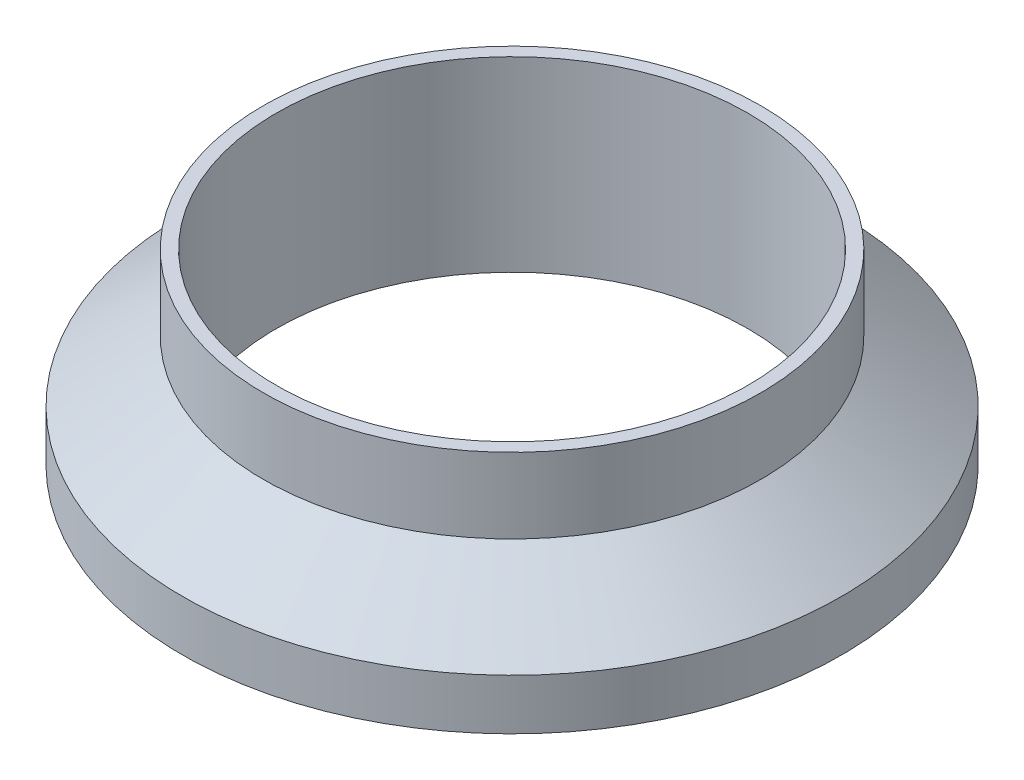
ISO-10303-21;
HEADER;
FILE_DESCRIPTION(('STEP AP214'),'2;1');
FILE_NAME('part.step','',(''),(''),'','','');
FILE_SCHEMA(('AUTOMOTIVE_DESIGN { 1 0 10303 214 1 1 1 1 }'));
ENDSEC;
DATA;
#1=APPLICATION_CONTEXT('core data for automotive mechanical design processes');
#2=APPLICATION_PROTOCOL_DEFINITION('international standard','automotive_design',2000,#1);
#3=PRODUCT_CONTEXT('',#1,'mechanical');
#4=PRODUCT('Part','Part','',(#3));
#5=PRODUCT_RELATED_PRODUCT_CATEGORY('part','',(#4));
#6=PRODUCT_DEFINITION_FORMATION('','',#4);
#7=PRODUCT_DEFINITION_CONTEXT('part definition',#1,'design');
#8=PRODUCT_DEFINITION('design','',#6,#7);
#9=PRODUCT_DEFINITION_SHAPE('','',#8);
#10=(LENGTH_UNIT() NAMED_UNIT(*) SI_UNIT(.MILLI.,.METRE.));
#11=(NAMED_UNIT(*) PLANE_ANGLE_UNIT() SI_UNIT($,.RADIAN.));
#12=(NAMED_UNIT(*) SI_UNIT($,.STERADIAN.) SOLID_ANGLE_UNIT());
#13=UNCERTAINTY_MEASURE_WITH_UNIT(LENGTH_MEASURE(1.E-05),#10,'distance_accuracy_value','');
#14=(GEOMETRIC_REPRESENTATION_CONTEXT(3) GLOBAL_UNCERTAINTY_ASSIGNED_CONTEXT((#13)) GLOBAL_UNIT_ASSIGNED_CONTEXT((#10,
#11,#12)) REPRESENTATION_CONTEXT('',''));
#15=CARTESIAN_POINT('',(0.,0.,0.));
#16=DIRECTION('',(0.,0.,1.));
#17=DIRECTION('',(1.,0.,0.));
#18=AXIS2_PLACEMENT_3D('',#15,#16,#17);
#19=CARTESIAN_POINT('',(-30.099,0.,0.));
#20=DIRECTION('',(0.,1.,0.));
#21=DIRECTION('',(0.,0.,1.));
#22=AXIS2_PLACEMENT_3D('',#19,#20,#21);
#23=PLANE('',#22);
#24=CARTESIAN_POINT('',(0.,0.,0.));
#25=DIRECTION('',(0.,-1.,0.));
#26=DIRECTION('',(0.,0.,-1.));
#27=AXIS2_PLACEMENT_3D('',#24,#25,#26);
#28=CIRCLE('',#27,30.099);
#29=CARTESIAN_POINT('',(0.,0.,-30.099));
#30=VERTEX_POINT('',#29);
#31=EDGE_CURVE('E10',#30,#30,#28,.T.);
#32=ORIENTED_EDGE('',*,*,#31,.F.);
#33=EDGE_LOOP('',(#32));
#34=FACE_BOUND('',#33,.T.);
#35=CARTESIAN_POINT('',(0.,0.,0.));
#36=DIRECTION('',(0.,-1.,0.));
#37=DIRECTION('',(0.,0.,-1.));
#38=AXIS2_PLACEMENT_3D('',#35,#36,#37);
#39=CIRCLE('',#38,34.9209836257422);
#40=CARTESIAN_POINT('',(0.,0.,-34.9209836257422));
#41=VERTEX_POINT('',#40);
#42=EDGE_CURVE('E59',#41,#41,#39,.T.);
#43=ORIENTED_EDGE('',*,*,#42,.T.);
#44=EDGE_LOOP('',(#43));
#45=FACE_BOUND('',#44,.T.);
#46=ADVANCED_FACE('F31',(#34,#45),#23,.F.);
#47=CARTESIAN_POINT('',(0.,0.,0.));
#48=DIRECTION('',(0.,-1.,0.));
#49=DIRECTION('',(0.,0.,-1.));
#50=AXIS2_PLACEMENT_3D('',#47,#48,#49);
#51=CYLINDRICAL_SURFACE('',#50,30.099);
#52=CARTESIAN_POINT('',(0.,23.8252,0.));
#53=DIRECTION('',(0.,-1.,0.));
#54=DIRECTION('',(0.,0.,-1.));
#55=AXIS2_PLACEMENT_3D('',#52,#53,#54);
#56=CIRCLE('',#55,30.099);
#57=CARTESIAN_POINT('',(0.,23.8252,-30.099));
#58=VERTEX_POINT('',#57);
#59=EDGE_CURVE('E37',#58,#58,#56,.T.);
#60=ORIENTED_EDGE('',*,*,#59,.F.);
#61=EDGE_LOOP('',(#60));
#62=FACE_BOUND('',#61,.T.);
#63=ORIENTED_EDGE('',*,*,#31,.T.);
#64=EDGE_LOOP('',(#63));
#65=FACE_BOUND('',#64,.T.);
#66=ADVANCED_FACE('F96',(#62,#65),#51,.F.);
#67=CARTESIAN_POINT('',(-30.099,23.8252,0.));
#68=DIRECTION('',(0.,-1.,0.));
#69=DIRECTION('',(0.,0.,-1.));
#70=AXIS2_PLACEMENT_3D('',#67,#68,#69);
#71=PLANE('',#70);
#72=CARTESIAN_POINT('',(0.,23.8252,0.));
#73=DIRECTION('',(0.,-1.,0.));
#74=DIRECTION('',(0.,0.,-1.));
#75=AXIS2_PLACEMENT_3D('',#72,#73,#74);
#76=CIRCLE('',#75,31.75);
#77=CARTESIAN_POINT('',(0.,23.8252,-31.75));
#78=VERTEX_POINT('',#77);
#79=EDGE_CURVE('E41',#78,#78,#76,.T.);
#80=ORIENTED_EDGE('',*,*,#79,.F.);
#81=EDGE_LOOP('',(#80));
#82=FACE_BOUND('',#81,.T.);
#83=ORIENTED_EDGE('',*,*,#59,.T.);
#84=EDGE_LOOP('',(#83));
#85=FACE_BOUND('',#84,.T.);
#86=ADVANCED_FACE('F91',(#82,#85),#71,.F.);
#87=CARTESIAN_POINT('',(0.,0.,0.));
#88=DIRECTION('',(0.,-1.,0.));
#89=DIRECTION('',(0.,0.,-1.));
#90=AXIS2_PLACEMENT_3D('',#87,#88,#89);
#91=CYLINDRICAL_SURFACE('',#90,31.75);
#92=CARTESIAN_POINT('',(0.,14.24795078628,0.));
#93=DIRECTION('',(0.,-1.,0.));
#94=DIRECTION('',(0.,0.,-1.));
#95=AXIS2_PLACEMENT_3D('',#92,#93,#94);
#96=CIRCLE('',#95,31.75);
#97=CARTESIAN_POINT('',(0.,14.24795078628,-31.75));
#98=VERTEX_POINT('',#97);
#99=EDGE_CURVE('E45',#98,#98,#96,.T.);
#100=ORIENTED_EDGE('',*,*,#99,.F.);
#101=EDGE_LOOP('',(#100));
#102=FACE_BOUND('',#101,.T.);
#103=ORIENTED_EDGE('',*,*,#79,.T.);
#104=EDGE_LOOP('',(#103));
#105=FACE_BOUND('',#104,.T.);
#106=ADVANCED_FACE('F85',(#102,#105),#91,.T.);
#107=CARTESIAN_POINT('',(0.,14.24795078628,0.));
#108=DIRECTION('',(0.,-1.,0.));
#109=DIRECTION('',(0.,0.,-1.));
#110=AXIS2_PLACEMENT_3D('',#107,#108,#109);
#111=CONICAL_SURFACE('',#110,31.75,0.925024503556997);
#112=CARTESIAN_POINT('',(0.,6.477,0.));
#113=DIRECTION('',(0.,-1.,0.));
#114=DIRECTION('',(0.,0.,-1.));
#115=AXIS2_PLACEMENT_3D('',#112,#113,#114);
#116=CIRCLE('',#115,42.0624);
#117=CARTESIAN_POINT('',(0.,6.477,-42.0624));
#118=VERTEX_POINT('',#117);
#119=EDGE_CURVE('E50',#118,#118,#116,.T.);
#120=ORIENTED_EDGE('',*,*,#119,.F.);
#121=EDGE_LOOP('',(#120));
#122=FACE_BOUND('',#121,.T.);
#123=ORIENTED_EDGE('',*,*,#99,.T.);
#124=EDGE_LOOP('',(#123));
#125=FACE_BOUND('',#124,.T.);
#126=ADVANCED_FACE('F79',(#122,#125),#111,.T.);
#127=CARTESIAN_POINT('',(0.,0.,0.));
#128=DIRECTION('',(0.,-1.,0.));
#129=DIRECTION('',(0.,0.,-1.));
#130=AXIS2_PLACEMENT_3D('',#127,#128,#129);
#131=CYLINDRICAL_SURFACE('',#130,42.0624);
#132=CARTESIAN_POINT('',(0.,0.,0.));
#133=DIRECTION('',(0.,-1.,0.));
#134=DIRECTION('',(0.,0.,-1.));
#135=AXIS2_PLACEMENT_3D('',#132,#133,#134);
#136=CIRCLE('',#135,42.0624);
#137=CARTESIAN_POINT('',(0.,0.,-42.0624));
#138=VERTEX_POINT('',#137);
#139=EDGE_CURVE('E53',#138,#138,#136,.T.);
#140=ORIENTED_EDGE('',*,*,#139,.F.);
#141=EDGE_LOOP('',(#140));
#142=FACE_BOUND('',#141,.T.);
#143=ORIENTED_EDGE('',*,*,#119,.T.);
#144=EDGE_LOOP('',(#143));
#145=FACE_BOUND('',#144,.T.);
#146=ADVANCED_FACE('F73',(#142,#145),#131,.T.);
#147=CARTESIAN_POINT('',(-42.0624,0.,0.));
#148=DIRECTION('',(0.,1.,0.));
#149=DIRECTION('',(0.,0.,1.));
#150=AXIS2_PLACEMENT_3D('',#147,#148,#149);
#151=PLANE('',#150);
#152=CARTESIAN_POINT('',(0.,0.,0.));
#153=DIRECTION('',(0.,-1.,0.));
#154=DIRECTION('',(0.,0.,-1.));
#155=AXIS2_PLACEMENT_3D('',#152,#153,#154);
#156=CIRCLE('',#155,37.9770163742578);
#157=CARTESIAN_POINT('',(0.,0.,-37.9770163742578));
#158=VERTEX_POINT('',#157);
#159=EDGE_CURVE('E56',#158,#158,#156,.T.);
#160=ORIENTED_EDGE('',*,*,#159,.F.);
#161=EDGE_LOOP('',(#160));
#162=FACE_BOUND('',#161,.T.);
#163=ORIENTED_EDGE('',*,*,#139,.T.);
#164=EDGE_LOOP('',(#163));
#165=FACE_BOUND('',#164,.T.);
#166=ADVANCED_FACE('F67',(#162,#165),#151,.F.);
#167=CARTESIAN_POINT('',(0.,-0.381,0.));
#168=DIRECTION('',(0.,-1.,0.));
#169=DIRECTION('',(0.,0.,-1.));
#170=AXIS2_PLACEMENT_3D('',#167,#168,#169);
#171=TOROIDAL_SURFACE('',#170,36.449,1.57479999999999);
#172=ORIENTED_EDGE('',*,*,#42,.F.);
#173=EDGE_LOOP('',(#172));
#174=FACE_BOUND('',#173,.T.);
#175=ORIENTED_EDGE('',*,*,#159,.T.);
#176=EDGE_LOOP('',(#175));
#177=FACE_BOUND('',#176,.T.);
#178=ADVANCED_FACE('F64',(#174,#177),#171,.F.);
#179=CLOSED_SHELL('',(#46,#66,#86,#106,#126,#146,#166,#178));
#180=MANIFOLD_SOLID_BREP('B2',#179);
#181=ADVANCED_BREP_SHAPE_REPRESENTATION('',(#18,#180),#14);
#182=SHAPE_DEFINITION_REPRESENTATION(#9,#181);
ENDSEC;
END-ISO-10303-21;
